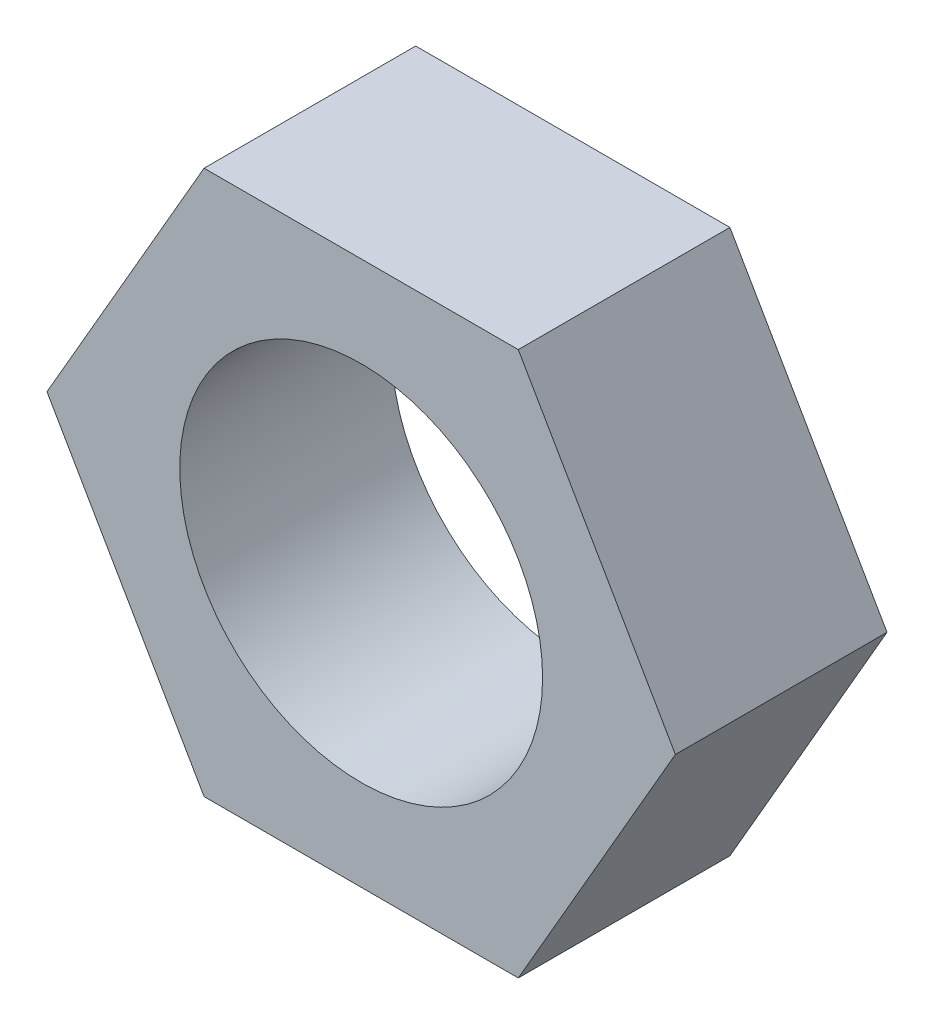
from build123d import *

# Parameters (mm, degrees)
SKETCH1_R      = 4.7625
EXTRUDE1_DEPTH = 5.55625


with BuildPart() as part:
    # Sketch1 → Extrude1 (new body)
    with BuildSketch(Plane.XY):
        Polygon((4.124445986, -7.14375), (8.248891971, 0), (4.124445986, 7.14375), (-4.124445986, 7.14375), (-8.248891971, 0), (-4.124445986, -7.14375), align=None)
        Circle(SKETCH1_R, mode=Mode.SUBTRACT)
    extrude(amount=EXTRUDE1_DEPTH)


solid = part.part
